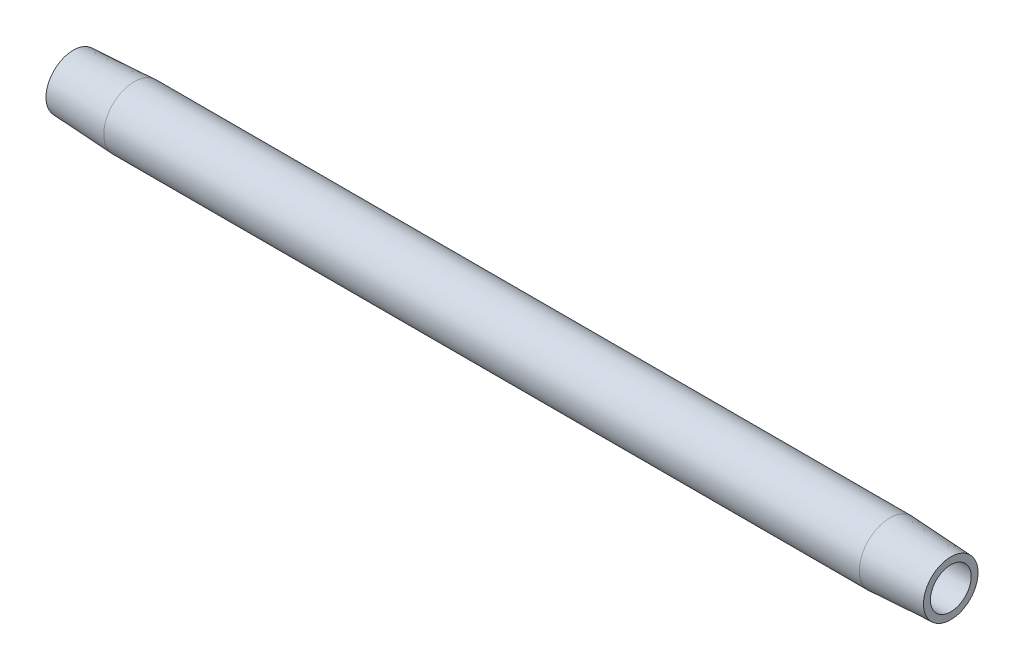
from build123d import *


with BuildPart() as part:
    # Sketch2 → Revolve1 (revolve)
    with BuildSketch(Plane.XY, mode=Mode.PRIVATE) as revolve1_sk:
        Polygon((7.9375, 3.96875), (0, 3.552763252), (0, 2.6543), (114.3, 2.6543), (114.3, 3.552763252), (106.3625, 3.96875), align=None)
    revolve(revolve1_sk.sketch.rotate(Axis((0.476141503, 0, 0), (1, 0, 0)), 90), axis=Axis((0.476141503, 0, 0), (1, 0, 0)))


solid = part.part
